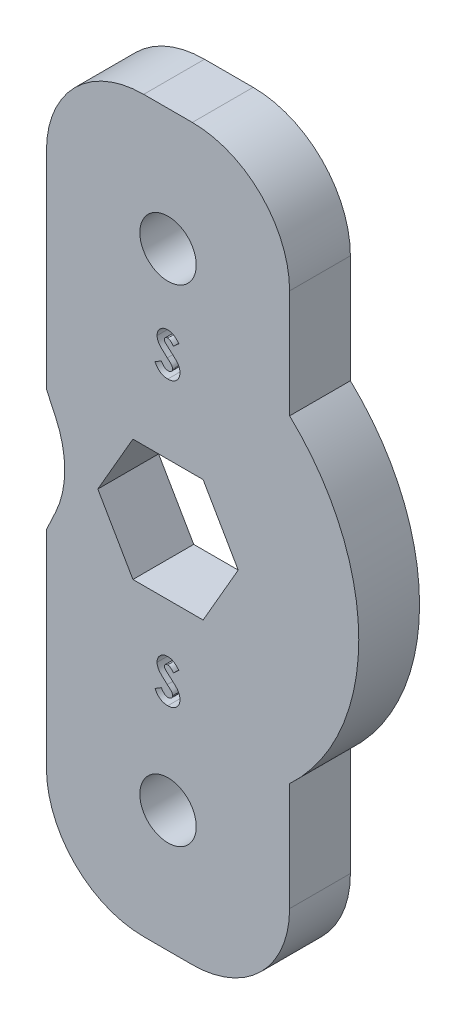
from build123d import *

# Parameters (mm, degrees)
BOSS_EXTRUDE1_DEPTH   = 3.175
FILLET1_R             = 5.08
F_4_CLEARANCE_HOLE1_D = 2.9464
CUT_EXTRUDE1_DEPTH    = 41.286233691
BOSS_EXTRUDE2_DEPTH   = 3.175


with BuildPart() as part:
    # Sketch1 → Boss-Extrude1 (new body)
    with BuildSketch(Plane.XY):
        Polygon((0, 38.1), (0, 22.225), (1.479928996, 19.05), (0, 15.875), (0, 0), (12.7, 0), (12.7, 15.875), (11.220071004, 19.05), (12.7, 22.225), (12.7, 38.1), align=None)
        Polygon((8.183087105, 22.225), (4.516912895, 22.225), (2.683825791, 19.05), (4.516912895, 15.875), (8.183087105, 15.875), (10.016174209, 19.05), align=None, mode=Mode.SUBTRACT)
    extrude(amount=BOSS_EXTRUDE1_DEPTH)

    # Fillet1
    fillet1_edges = [part.edges().sort_by_distance(p)[0] for p in [
        (1.479928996, 19.05, 1.5875),
        (0, 38.1, 1.5875),
        (12.7, 38.1, 1.5875),
        (11.220071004, 19.05, 1.5875),
        (12.7, 0, 1.5875),
        (0, 0, 1.5875),
    ]]
    fillet(fillet1_edges, radius=FILLET1_R)

    # 4 Clearance Hole1 (through all)
    with Locations(Plane(origin=(0, 0, 0), x_dir=(-1, 0, 0), z_dir=(0, 0, -1))):
        with Locations((-6.35, 6.35), (-6.35, 31.75)):
            Hole(F_4_CLEARANCE_HOLE1_D / 2)

    # Sketch4 → Cut-Extrude1 (cut, through all)
    with BuildSketch(Plane.XY.offset(3.175)):
        with BuildLine():
            Line((6.917700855, 27.740176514), (6.633612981, 27.48025731))
            add(Edge.make_bspline(
                [(6.633612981, 27.48025731), (6.621443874, 27.497423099), (6.598080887, 27.530379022), (6.560211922, 27.574507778), (6.522513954, 27.612152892), (6.484637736, 27.643157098), (6.446247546, 27.667332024), (6.407410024, 27.684448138), (6.368345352, 27.695329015), (6.342099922, 27.696683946), (6.329172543, 27.697351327)],
                knots=[0, 0, 0, 0, 1.299362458, 2.494594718, 3.587462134, 4.587049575, 5.512617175, 6.380583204, 7.202344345, 8, 8, 8, 8], degree=3))
            add(Edge.make_bspline(
                [(6.329172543, 27.697351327), (6.317114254, 27.696928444), (6.293832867, 27.696111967), (6.260643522, 27.68799625), (6.231177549, 27.673989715), (6.205463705, 27.655674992), (6.185094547, 27.633609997), (6.168831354, 27.610469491), (6.159673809, 27.584927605), (6.158468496, 27.567384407), (6.157871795, 27.558699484)],
                knots=[0, 0, 0, 0, 1.185010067, 2.2879431, 3.333075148, 4.379039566, 5.372662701, 6.27520591, 7.14612461, 8, 8, 8, 8], degree=3))
            add(Edge.make_bspline(
                [(6.157871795, 27.558699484), (6.158245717, 27.54988932), (6.158998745, 27.532146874), (6.166271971, 27.50614311), (6.177234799, 27.480734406), (6.187710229, 27.465266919), (6.19306477, 27.457360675)],
                knots=[0, 0, 0, 0, 0.967525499, 1.948461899, 2.951351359, 4, 4, 4, 4], degree=3))
            add(Edge.make_bspline(
                [(6.19306477, 27.457360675), (6.197932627, 27.451215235), (6.209137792, 27.437069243), (6.230503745, 27.414664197), (6.257334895, 27.387216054), (6.290663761, 27.355668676), (6.329106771, 27.318887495), (6.374445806, 27.278318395), (6.425375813, 27.232704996), (6.461575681, 27.200941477), (6.480544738, 27.184297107)],
                knots=[0, 0, 0, 0, 0.473873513, 1.090794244, 1.870441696, 2.795289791, 3.865433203, 5.087734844, 6.473946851, 8, 8, 8, 8], degree=3))
            add(Edge.make_bspline(
                [(6.480544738, 27.184297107), (6.498349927, 27.168887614), (6.532140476, 27.139643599), (6.580217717, 27.098136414), (6.622469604, 27.060793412), (6.659511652, 27.028175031), (6.690782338, 26.99993903), (6.716413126, 26.975950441), (6.736717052, 26.956676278), (6.748258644, 26.945034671), (6.753184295, 26.940066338)],
                knots=[0, 0, 0, 0, 1.543621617, 2.929473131, 4.163658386, 5.240097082, 6.164993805, 6.925417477, 7.541396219, 8, 8, 8, 8], degree=3))
            add(Edge.make_bspline(
                [(6.753184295, 26.940066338), (6.771871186, 26.919843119), (6.807793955, 26.88096699), (6.85448089, 26.820721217), (6.892905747, 26.761909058), (6.922631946, 26.703423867), (6.945082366, 26.644421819), (6.96091021, 26.583455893), (6.970389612, 26.519889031), (6.971442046, 26.476512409), (6.971974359, 26.454572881)],
                knots=[0, 0, 0, 0, 1.206664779, 2.319633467, 3.337109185, 4.282041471, 5.190008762, 6.099243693, 7.03861361, 8, 8, 8, 8], degree=3))
            add(Edge.make_bspline(
                [(6.971974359, 26.454572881), (6.971595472, 26.433195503), (6.970852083, 26.39125229), (6.961746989, 26.329874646), (6.948763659, 26.271133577), (6.928689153, 26.215668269), (6.904222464, 26.162568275), (6.873549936, 26.112660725), (6.837529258, 26.065440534), (6.796244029, 26.02175182), (6.750577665, 25.982107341), (6.701596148, 25.946814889), (6.648820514, 25.917676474), (6.59270167, 25.893683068), (6.533269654, 25.875203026), (6.470595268, 25.861544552), (6.404582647, 25.853346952), (6.359442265, 25.85248999), (6.336380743, 25.852052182)],
                knots=[0, 0, 0, 0, 1.043214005, 2.046824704, 3.02475056, 3.976699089, 4.921714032, 5.875962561, 6.831408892, 7.817874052, 8.806269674, 9.781291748, 10.760897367, 11.74438705, 12.757449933, 13.795994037, 14.874007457, 16, 16, 16, 16], degree=3))
            add(Edge.make_bspline(
                [(6.336380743, 25.852052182), (6.318277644, 25.852373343), (6.282423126, 25.853009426), (6.229578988, 25.858202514), (6.178551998, 25.866583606), (6.129399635, 25.878596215), (6.081900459, 25.89381782), (6.036052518, 25.912410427), (5.992172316, 25.934662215), (5.949927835, 25.960115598), (5.909524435, 25.989670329), (5.870451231, 26.022722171), (5.833096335, 26.059779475), (5.797280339, 26.100754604), (5.763232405, 26.145763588), (5.72983802, 26.194179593), (5.698581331, 26.246901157), (5.679272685, 26.28388576), (5.669410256, 26.302776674)],
                knots=[0, 0, 0, 0, 1.016823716, 2.013894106, 2.979844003, 3.91962641, 4.853723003, 5.779685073, 6.695824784, 7.614987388, 8.547259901, 9.504950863, 10.487499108, 11.500346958, 12.559593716, 13.656357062, 14.802919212, 16, 16, 16, 16], degree=3))
            Line((5.669410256, 26.302776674), (6.003531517, 26.503334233))
            add(Edge.make_bspline(
                [(6.003531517, 26.503334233), (6.015867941, 26.481890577), (6.039517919, 26.440781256), (6.079595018, 26.385545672), (6.12065196, 26.338245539), (6.163637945, 26.299716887), (6.208030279, 26.26944454), (6.254043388, 26.247809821), (6.301709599, 26.234417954), (6.334177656, 26.232782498), (6.35037313, 26.231966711)],
                knots=[0, 0, 0, 0, 1.283663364, 2.460892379, 3.537111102, 4.529833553, 5.449777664, 6.316464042, 7.160231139, 8, 8, 8, 8], degree=3))
            add(Edge.make_bspline(
                [(6.35037313, 26.231966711), (6.366846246, 26.232632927), (6.398806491, 26.233925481), (6.44442565, 26.245864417), (6.486251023, 26.264609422), (6.522404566, 26.291355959), (6.553017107, 26.322225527), (6.575610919, 26.356569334), (6.589804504, 26.393728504), (6.59130511, 26.419541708), (6.592059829, 26.43252427)],
                knots=[0, 0, 0, 0, 1.13588714, 2.203786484, 3.234766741, 4.283437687, 5.291419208, 6.222934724, 7.106237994, 8, 8, 8, 8], degree=3))
            add(Edge.make_bspline(
                [(6.592059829, 26.43252427), (6.591362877, 26.444602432), (6.589947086, 26.469138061), (6.579518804, 26.505618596), (6.563216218, 26.54208254), (6.54392911, 26.571991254), (6.524302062, 26.597033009), (6.505534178, 26.618730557), (6.482679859, 26.64270255), (6.455797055, 26.668979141), (6.425240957, 26.69779165), (6.390985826, 26.729137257), (6.352639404, 26.762739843), (6.325536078, 26.785629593), (6.311364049, 26.797598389)],
                knots=[0, 0, 0, 0, 0.916159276, 1.861089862, 2.860218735, 3.940849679, 4.552606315, 5.27541173, 6.11797699, 7.06649574, 8.129236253, 9.306560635, 10.591630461, 12, 12, 12, 12], degree=3))
            add(Edge.make_bspline(
                [(6.311364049, 26.797598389), (6.284422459, 26.820393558), (6.232713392, 26.864144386), (6.159641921, 26.928762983), (6.093797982, 26.989154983), (6.035750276, 27.046066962), (5.984759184, 27.09844789), (5.94117004, 27.146723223), (5.90546169, 27.191265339), (5.867886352, 27.244022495), (5.832182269, 27.308310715), (5.801323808, 27.385656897), (5.781304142, 27.462993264), (5.779061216, 27.514912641), (5.777957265, 27.540466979)],
                knots=[0, 0, 0, 0, 1.345494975, 2.582412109, 3.71882943, 4.751509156, 5.681369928, 6.505683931, 7.230279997, 7.856715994, 8.973648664, 10.023341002, 11.027102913, 12, 12, 12, 12], degree=3))
            add(Edge.make_bspline(
                [(5.777957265, 27.540466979), (5.778416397, 27.558588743), (5.779320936, 27.594290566), (5.787389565, 27.646784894), (5.799448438, 27.69743751), (5.816961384, 27.74606361), (5.839691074, 27.792602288), (5.867295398, 27.83728137), (5.900203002, 27.87968964), (5.937287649, 27.919798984), (5.978145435, 27.956454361), (6.021807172, 27.988806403), (6.068025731, 28.016131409), (6.116518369, 28.038799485), (6.167585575, 28.056150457), (6.22085114, 28.068449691), (6.276391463, 28.075764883), (6.314168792, 28.076759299), (6.33341266, 28.077265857)],
                knots=[0, 0, 0, 0, 1.010766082, 1.991317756, 2.957454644, 3.913069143, 4.869106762, 5.843196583, 6.838735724, 7.860187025, 8.887984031, 9.89767229, 10.887916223, 11.879572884, 12.879850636, 13.892031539, 14.926195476, 16, 16, 16, 16], degree=3))
            add(Edge.make_bspline(
                [(6.33341266, 28.077265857), (6.358351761, 28.076353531), (6.408033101, 28.074536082), (6.481488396, 28.060324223), (6.553236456, 28.037974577), (6.611052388, 28.011012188), (6.657055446, 27.984893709), (6.692312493, 27.960847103), (6.728188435, 27.933300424), (6.764972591, 27.902166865), (6.801981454, 27.866859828), (6.840267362, 27.828219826), (6.879308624, 27.785912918), (6.904679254, 27.755689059), (6.917700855, 27.740176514)],
                knots=[0, 0, 0, 0, 1.282922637, 2.555718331, 3.837320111, 5.142675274, 5.830281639, 6.55870424, 7.337177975, 8.157850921, 9.037902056, 9.96903443, 10.957596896, 12, 12, 12, 12], degree=3))
        make_face()
        with BuildLine():
            Line((6.917700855, 12.962066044), (6.633612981, 12.70214684))
            add(Edge.make_bspline(
                [(6.633612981, 12.70214684), (6.621443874, 12.71931263), (6.598080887, 12.752268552), (6.560211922, 12.796397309), (6.522513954, 12.834042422), (6.484637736, 12.865046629), (6.446247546, 12.889221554), (6.407410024, 12.906337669), (6.368345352, 12.917218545), (6.342099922, 12.918573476), (6.329172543, 12.919240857)],
                knots=[0, 0, 0, 0, 1.299362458, 2.494594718, 3.587462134, 4.587049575, 5.512617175, 6.380583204, 7.202344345, 8, 8, 8, 8], degree=3))
            add(Edge.make_bspline(
                [(6.329172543, 12.919240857), (6.317114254, 12.918817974), (6.293832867, 12.918001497), (6.260643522, 12.909885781), (6.231177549, 12.895879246), (6.205463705, 12.877564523), (6.185094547, 12.855499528), (6.168831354, 12.832359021), (6.159673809, 12.806817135), (6.158468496, 12.789273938), (6.157871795, 12.780589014)],
                knots=[0, 0, 0, 0, 1.185010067, 2.2879431, 3.333075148, 4.379039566, 5.372662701, 6.27520591, 7.14612461, 8, 8, 8, 8], degree=3))
            add(Edge.make_bspline(
                [(6.157871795, 12.780589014), (6.158245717, 12.77177885), (6.158998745, 12.754036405), (6.166271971, 12.728032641), (6.177234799, 12.702623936), (6.187710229, 12.687156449), (6.19306477, 12.679250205)],
                knots=[0, 0, 0, 0, 0.967525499, 1.948461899, 2.951351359, 4, 4, 4, 4], degree=3))
            add(Edge.make_bspline(
                [(6.19306477, 12.679250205), (6.197932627, 12.673104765), (6.209137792, 12.658958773), (6.230503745, 12.636553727), (6.257334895, 12.609105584), (6.290663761, 12.577558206), (6.329106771, 12.540777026), (6.374445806, 12.500207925), (6.425375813, 12.454594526), (6.461575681, 12.422831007), (6.480544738, 12.406186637)],
                knots=[0, 0, 0, 0, 0.473873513, 1.090794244, 1.870441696, 2.795289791, 3.865433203, 5.087734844, 6.473946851, 8, 8, 8, 8], degree=3))
            add(Edge.make_bspline(
                [(6.480544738, 12.406186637), (6.498349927, 12.390777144), (6.532140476, 12.361533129), (6.580217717, 12.320025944), (6.622469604, 12.282682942), (6.659511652, 12.250064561), (6.690782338, 12.22182856), (6.716413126, 12.197839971), (6.736717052, 12.178565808), (6.748258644, 12.166924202), (6.753184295, 12.161955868)],
                knots=[0, 0, 0, 0, 1.543621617, 2.929473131, 4.163658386, 5.240097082, 6.164993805, 6.925417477, 7.541396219, 8, 8, 8, 8], degree=3))
            add(Edge.make_bspline(
                [(6.753184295, 12.161955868), (6.771871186, 12.141732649), (6.807793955, 12.10285652), (6.85448089, 12.042610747), (6.892905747, 11.983798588), (6.922631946, 11.925313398), (6.945082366, 11.86631135), (6.96091021, 11.805345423), (6.970389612, 11.741778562), (6.971442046, 11.698401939), (6.971974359, 11.676462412)],
                knots=[0, 0, 0, 0, 1.206664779, 2.319633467, 3.337109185, 4.282041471, 5.190008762, 6.099243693, 7.03861361, 8, 8, 8, 8], degree=3))
            add(Edge.make_bspline(
                [(6.971974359, 11.676462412), (6.971595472, 11.655085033), (6.970852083, 11.61314182), (6.961746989, 11.551764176), (6.948763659, 11.493023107), (6.928689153, 11.437557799), (6.904222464, 11.384457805), (6.873549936, 11.334550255), (6.837529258, 11.287330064), (6.796244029, 11.24364135), (6.750577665, 11.203996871), (6.701596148, 11.168704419), (6.648820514, 11.139566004), (6.59270167, 11.115572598), (6.533269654, 11.097092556), (6.470595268, 11.083434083), (6.404582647, 11.075236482), (6.359442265, 11.07437952), (6.336380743, 11.073941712)],
                knots=[0, 0, 0, 0, 1.043214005, 2.046824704, 3.02475056, 3.976699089, 4.921714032, 5.875962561, 6.831408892, 7.817874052, 8.806269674, 9.781291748, 10.760897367, 11.74438705, 12.757449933, 13.795994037, 14.874007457, 16, 16, 16, 16], degree=3))
            add(Edge.make_bspline(
                [(6.336380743, 11.073941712), (6.318277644, 11.074262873), (6.282423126, 11.074898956), (6.229578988, 11.080092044), (6.178551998, 11.088473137), (6.129399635, 11.100485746), (6.081900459, 11.11570735), (6.036052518, 11.134299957), (5.992172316, 11.156551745), (5.949927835, 11.182005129), (5.909524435, 11.21155986), (5.870451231, 11.244611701), (5.833096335, 11.281669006), (5.797280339, 11.322644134), (5.763232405, 11.367653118), (5.72983802, 11.416069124), (5.698581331, 11.468790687), (5.679272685, 11.50577529), (5.669410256, 11.524666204)],
                knots=[0, 0, 0, 0, 1.016823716, 2.013894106, 2.979844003, 3.91962641, 4.853723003, 5.779685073, 6.695824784, 7.614987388, 8.547259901, 9.504950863, 10.487499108, 11.500346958, 12.559593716, 13.656357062, 14.802919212, 16, 16, 16, 16], degree=3))
            Line((5.669410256, 11.524666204), (6.003531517, 11.725223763))
            add(Edge.make_bspline(
                [(6.003531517, 11.725223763), (6.015867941, 11.703780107), (6.039517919, 11.662670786), (6.079595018, 11.607435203), (6.12065196, 11.560135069), (6.163637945, 11.521606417), (6.208030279, 11.49133407), (6.254043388, 11.469699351), (6.301709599, 11.456307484), (6.334177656, 11.454672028), (6.35037313, 11.453856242)],
                knots=[0, 0, 0, 0, 1.283663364, 2.460892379, 3.537111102, 4.529833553, 5.449777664, 6.316464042, 7.160231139, 8, 8, 8, 8], degree=3))
            add(Edge.make_bspline(
                [(6.35037313, 11.453856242), (6.366846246, 11.454522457), (6.398806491, 11.455815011), (6.44442565, 11.467753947), (6.486251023, 11.486498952), (6.522404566, 11.513245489), (6.553017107, 11.544115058), (6.575610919, 11.578458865), (6.589804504, 11.615618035), (6.59130511, 11.641431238), (6.592059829, 11.654413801)],
                knots=[0, 0, 0, 0, 1.13588714, 2.203786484, 3.234766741, 4.283437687, 5.291419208, 6.222934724, 7.106237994, 8, 8, 8, 8], degree=3))
            add(Edge.make_bspline(
                [(6.592059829, 11.654413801), (6.591362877, 11.666491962), (6.589947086, 11.691027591), (6.579518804, 11.727508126), (6.563216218, 11.763972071), (6.54392911, 11.793880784), (6.524302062, 11.81892254), (6.505534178, 11.840620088), (6.482679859, 11.86459208), (6.455797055, 11.890868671), (6.425240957, 11.919681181), (6.390985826, 11.951026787), (6.352639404, 11.984629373), (6.325536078, 12.007519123), (6.311364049, 12.019487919)],
                knots=[0, 0, 0, 0, 0.916159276, 1.861089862, 2.860218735, 3.940849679, 4.552606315, 5.27541173, 6.11797699, 7.06649574, 8.129236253, 9.306560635, 10.591630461, 12, 12, 12, 12], degree=3))
            add(Edge.make_bspline(
                [(6.311364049, 12.019487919), (6.284422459, 12.042283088), (6.232713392, 12.086033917), (6.159641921, 12.150652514), (6.093797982, 12.211044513), (6.035750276, 12.267956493), (5.984759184, 12.32033742), (5.94117004, 12.368612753), (5.90546169, 12.413154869), (5.867886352, 12.465912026), (5.832182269, 12.530200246), (5.801323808, 12.607546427), (5.781304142, 12.684882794), (5.779061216, 12.736802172), (5.777957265, 12.762356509)],
                knots=[0, 0, 0, 0, 1.345494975, 2.582412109, 3.71882943, 4.751509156, 5.681369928, 6.505683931, 7.230279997, 7.856715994, 8.973648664, 10.023341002, 11.027102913, 12, 12, 12, 12], degree=3))
            add(Edge.make_bspline(
                [(5.777957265, 12.762356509), (5.778416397, 12.780478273), (5.779320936, 12.816180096), (5.787389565, 12.868674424), (5.799448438, 12.91932704), (5.816961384, 12.96795314), (5.839691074, 13.014491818), (5.867295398, 13.0591709), (5.900203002, 13.10157917), (5.937287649, 13.141688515), (5.978145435, 13.178343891), (6.021807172, 13.210695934), (6.068025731, 13.238020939), (6.116518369, 13.260689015), (6.167585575, 13.278039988), (6.22085114, 13.290339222), (6.276391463, 13.297654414), (6.314168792, 13.298648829), (6.33341266, 13.299155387)],
                knots=[0, 0, 0, 0, 1.010766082, 1.991317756, 2.957454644, 3.913069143, 4.869106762, 5.843196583, 6.838735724, 7.860187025, 8.887984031, 9.89767229, 10.887916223, 11.879572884, 12.879850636, 13.892031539, 14.926195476, 16, 16, 16, 16], degree=3))
            add(Edge.make_bspline(
                [(6.33341266, 13.299155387), (6.358351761, 13.298243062), (6.408033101, 13.296425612), (6.481488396, 13.282213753), (6.553236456, 13.259864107), (6.611052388, 13.232901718), (6.657055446, 13.206783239), (6.692312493, 13.182736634), (6.728188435, 13.155189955), (6.764972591, 13.124056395), (6.801981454, 13.088749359), (6.840267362, 13.050109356), (6.879308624, 13.007802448), (6.904679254, 12.977578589), (6.917700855, 12.962066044)],
                knots=[0, 0, 0, 0, 1.282922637, 2.555718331, 3.837320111, 5.142675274, 5.830281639, 6.55870424, 7.337177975, 8.157850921, 9.037902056, 9.96903443, 10.957596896, 12, 12, 12, 12], degree=3))
        make_face()
    extrude(amount=-CUT_EXTRUDE1_DEPTH, mode=Mode.SUBTRACT)

    # Sketch5 → Boss-Extrude2 (add)
    with BuildSketch(Plane.XY):
        with BuildLine():
            Line((11.026941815, 28.660061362), (11.026941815, 9.439938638))
            ThreePointArc((11.026941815, 9.439938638), (16.312525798, 19.05), (11.026941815, 28.660061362))
        make_face()
    extrude(amount=BOSS_EXTRUDE2_DEPTH)


solid = part.part
